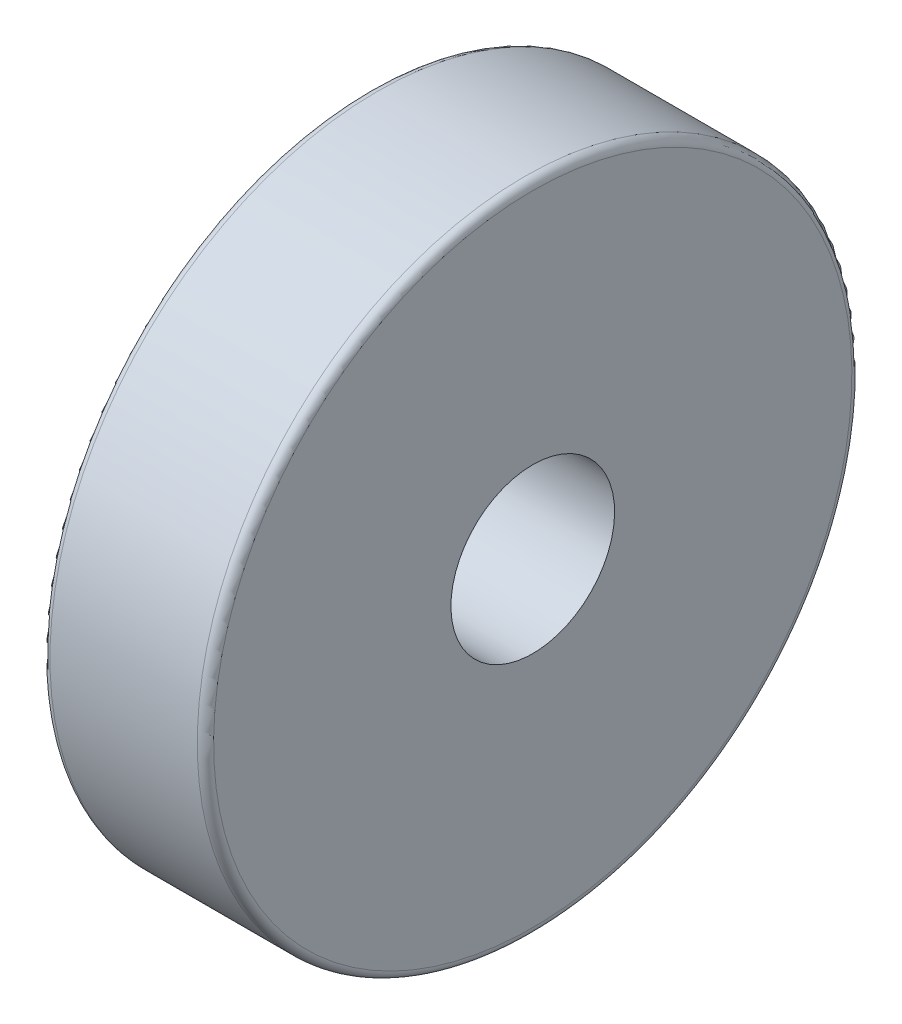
ISO-10303-21;
HEADER;
FILE_DESCRIPTION(('STEP AP214'),'2;1');
FILE_NAME('part.step','',(''),(''),'','','');
FILE_SCHEMA(('AUTOMOTIVE_DESIGN { 1 0 10303 214 1 1 1 1 }'));
ENDSEC;
DATA;
#1=APPLICATION_CONTEXT('core data for automotive mechanical design processes');
#2=APPLICATION_PROTOCOL_DEFINITION('international standard','automotive_design',2000,#1);
#3=PRODUCT_CONTEXT('',#1,'mechanical');
#4=PRODUCT('Part','Part','',(#3));
#5=PRODUCT_RELATED_PRODUCT_CATEGORY('part','',(#4));
#6=PRODUCT_DEFINITION_FORMATION('','',#4);
#7=PRODUCT_DEFINITION_CONTEXT('part definition',#1,'design');
#8=PRODUCT_DEFINITION('design','',#6,#7);
#9=PRODUCT_DEFINITION_SHAPE('','',#8);
#10=(LENGTH_UNIT() NAMED_UNIT(*) SI_UNIT(.MILLI.,.METRE.));
#11=(NAMED_UNIT(*) PLANE_ANGLE_UNIT() SI_UNIT($,.RADIAN.));
#12=(NAMED_UNIT(*) SI_UNIT($,.STERADIAN.) SOLID_ANGLE_UNIT());
#13=UNCERTAINTY_MEASURE_WITH_UNIT(LENGTH_MEASURE(1.E-05),#10,'distance_accuracy_value','');
#14=(GEOMETRIC_REPRESENTATION_CONTEXT(3) GLOBAL_UNCERTAINTY_ASSIGNED_CONTEXT((#13)) GLOBAL_UNIT_ASSIGNED_CONTEXT((#10,
#11,#12)) REPRESENTATION_CONTEXT('',''));
#15=CARTESIAN_POINT('',(0.,0.,0.));
#16=DIRECTION('',(0.,0.,1.));
#17=DIRECTION('',(1.,0.,0.));
#18=AXIS2_PLACEMENT_3D('',#15,#16,#17);
#19=CARTESIAN_POINT('',(-1.,0.,0.));
#20=DIRECTION('',(1.,0.,0.));
#21=DIRECTION('',(0.,1.,0.));
#22=AXIS2_PLACEMENT_3D('',#19,#20,#21);
#23=CYLINDRICAL_SURFACE('',#22,2.);
#24=CARTESIAN_POINT('',(-2.,0.,0.));
#25=DIRECTION('',(1.,0.,0.));
#26=DIRECTION('',(0.,1.,0.));
#27=AXIS2_PLACEMENT_3D('',#24,#25,#26);
#28=CIRCLE('',#27,2.);
#29=CARTESIAN_POINT('',(-2.,2.,0.));
#30=VERTEX_POINT('',#29);
#31=EDGE_CURVE('E72',#30,#30,#28,.T.);
#32=ORIENTED_EDGE('',*,*,#31,.F.);
#33=EDGE_LOOP('',(#32));
#34=FACE_BOUND('',#33,.T.);
#35=CARTESIAN_POINT('',(2.,0.,0.));
#36=DIRECTION('',(1.,0.,0.));
#37=DIRECTION('',(0.,1.,0.));
#38=AXIS2_PLACEMENT_3D('',#35,#36,#37);
#39=CIRCLE('',#38,2.);
#40=CARTESIAN_POINT('',(2.,2.,0.));
#41=VERTEX_POINT('',#40);
#42=EDGE_CURVE('E11',#41,#41,#39,.T.);
#43=ORIENTED_EDGE('',*,*,#42,.T.);
#44=EDGE_LOOP('',(#43));
#45=FACE_BOUND('',#44,.T.);
#46=ADVANCED_FACE('F17',(#34,#45),#23,.F.);
#47=CARTESIAN_POINT('',(2.,4.82842712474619,0.));
#48=DIRECTION('',(1.,0.,0.));
#49=DIRECTION('',(0.,1.,0.));
#50=AXIS2_PLACEMENT_3D('',#47,#48,#49);
#51=PLANE('',#50);
#52=ORIENTED_EDGE('',*,*,#42,.F.);
#53=EDGE_LOOP('',(#52));
#54=FACE_BOUND('',#53,.T.);
#55=CARTESIAN_POINT('',(2.,0.,0.));
#56=DIRECTION('',(-1.,0.,0.));
#57=DIRECTION('',(0.,-1.,0.));
#58=AXIS2_PLACEMENT_3D('',#55,#56,#57);
#59=CIRCLE('',#58,7.8);
#60=CARTESIAN_POINT('',(2.,7.8,0.));
#61=VERTEX_POINT('',#60);
#62=EDGE_CURVE('E20',#61,#61,#59,.T.);
#63=ORIENTED_EDGE('',*,*,#62,.F.);
#64=EDGE_LOOP('',(#63));
#65=FACE_BOUND('',#64,.T.);
#66=ADVANCED_FACE('F95',(#54,#65),#51,.T.);
#67=CARTESIAN_POINT('',(1.8,0.,0.));
#68=DIRECTION('',(1.,0.,0.));
#69=DIRECTION('',(0.,0.,-1.));
#70=AXIS2_PLACEMENT_3D('',#67,#68,#69);
#71=TOROIDAL_SURFACE('',#70,7.8,0.2);
#72=ORIENTED_EDGE('',*,*,#62,.T.);
#73=EDGE_LOOP('',(#72));
#74=FACE_BOUND('',#73,.T.);
#75=CARTESIAN_POINT('',(1.8,0.,0.));
#76=DIRECTION('',(1.,0.,0.));
#77=DIRECTION('',(0.,-1.,0.));
#78=AXIS2_PLACEMENT_3D('',#75,#76,#77);
#79=CIRCLE('',#78,8.);
#80=CARTESIAN_POINT('',(1.8,8.,0.));
#81=VERTEX_POINT('',#80);
#82=EDGE_CURVE('E68',#81,#81,#79,.T.);
#83=ORIENTED_EDGE('',*,*,#82,.T.);
#84=EDGE_LOOP('',(#83));
#85=FACE_BOUND('',#84,.T.);
#86=ADVANCED_FACE('F103',(#74,#85),#71,.T.);
#87=CARTESIAN_POINT('',(-2.,7.82842712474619,0.));
#88=DIRECTION('',(-1.,0.,0.));
#89=DIRECTION('',(0.,0.,1.));
#90=AXIS2_PLACEMENT_3D('',#87,#88,#89);
#91=PLANE('',#90);
#92=ORIENTED_EDGE('',*,*,#31,.T.);
#93=EDGE_LOOP('',(#92));
#94=FACE_BOUND('',#93,.T.);
#95=CARTESIAN_POINT('',(-2.,0.,0.));
#96=DIRECTION('',(1.,0.,0.));
#97=DIRECTION('',(0.,-1.,0.));
#98=AXIS2_PLACEMENT_3D('',#95,#96,#97);
#99=CIRCLE('',#98,7.8);
#100=CARTESIAN_POINT('',(-2.,7.8,0.));
#101=VERTEX_POINT('',#100);
#102=EDGE_CURVE('E59',#101,#101,#99,.T.);
#103=ORIENTED_EDGE('',*,*,#102,.F.);
#104=EDGE_LOOP('',(#103));
#105=FACE_BOUND('',#104,.T.);
#106=ADVANCED_FACE('F108',(#94,#105),#91,.T.);
#107=CARTESIAN_POINT('',(1.,0.,0.));
#108=DIRECTION('',(1.,0.,0.));
#109=DIRECTION('',(0.,1.,0.));
#110=AXIS2_PLACEMENT_3D('',#107,#108,#109);
#111=CYLINDRICAL_SURFACE('',#110,8.);
#112=CARTESIAN_POINT('',(-1.8,0.,0.));
#113=DIRECTION('',(-1.,0.,0.));
#114=DIRECTION('',(0.,-1.,0.));
#115=AXIS2_PLACEMENT_3D('',#112,#113,#114);
#116=CIRCLE('',#115,8.);
#117=CARTESIAN_POINT('',(-1.8,8.,0.));
#118=VERTEX_POINT('',#117);
#119=EDGE_CURVE('E63',#118,#118,#116,.T.);
#120=ORIENTED_EDGE('',*,*,#119,.F.);
#121=EDGE_LOOP('',(#120));
#122=FACE_BOUND('',#121,.T.);
#123=ORIENTED_EDGE('',*,*,#82,.F.);
#124=EDGE_LOOP('',(#123));
#125=FACE_BOUND('',#124,.T.);
#126=ADVANCED_FACE('F112',(#122,#125),#111,.T.);
#127=CARTESIAN_POINT('',(-1.8,0.,0.));
#128=DIRECTION('',(1.,0.,0.));
#129=DIRECTION('',(0.,0.,-1.));
#130=AXIS2_PLACEMENT_3D('',#127,#128,#129);
#131=TOROIDAL_SURFACE('',#130,7.8,0.2);
#132=ORIENTED_EDGE('',*,*,#119,.T.);
#133=EDGE_LOOP('',(#132));
#134=FACE_BOUND('',#133,.T.);
#135=ORIENTED_EDGE('',*,*,#102,.T.);
#136=EDGE_LOOP('',(#135));
#137=FACE_BOUND('',#136,.T.);
#138=ADVANCED_FACE('F60',(#134,#137),#131,.T.);
#139=CLOSED_SHELL('',(#46,#66,#86,#106,#126,#138));
#140=MANIFOLD_SOLID_BREP('B1',#139);
#141=ADVANCED_BREP_SHAPE_REPRESENTATION('',(#18,#140),#14);
#142=SHAPE_DEFINITION_REPRESENTATION(#9,#141);
ENDSEC;
END-ISO-10303-21;
